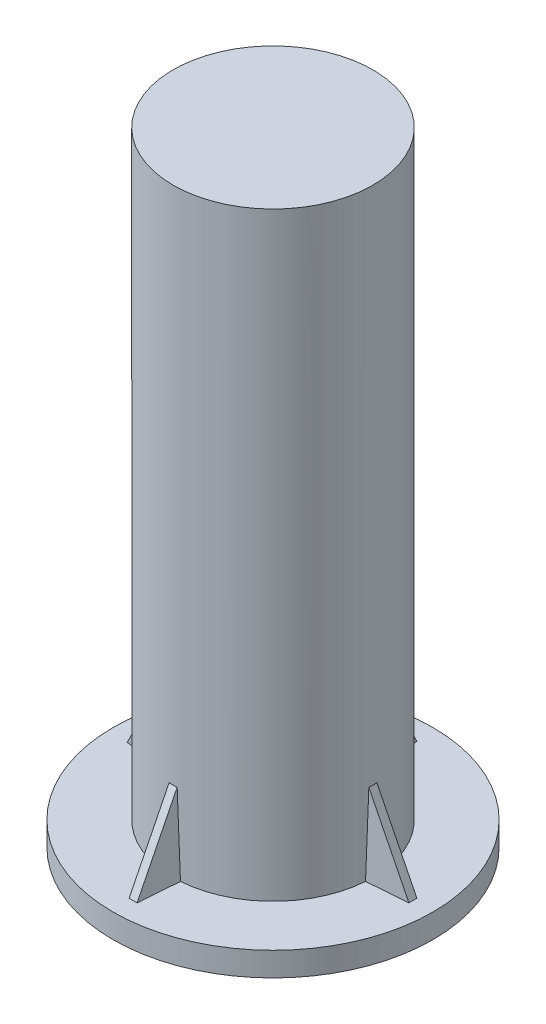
from build123d import *

# Parameters (mm, degrees)
CROQUIS1_R              = 40
CROQUIS1_R_2            = 5
SALIENTE_EXTRUIR2_DEPTH = 6
CROQUIS3_R              = 25
SALIENTE_EXTRUIR3_DEPTH = 150
NERVIO26_REACH          = 167.94
CROQUIS9_WALL_W         = 356.240175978
CROQUIS9_WALL_H         = 3
NERVIO26_DRAFT_ANGLE    = 5
NERVIO27_REACH          = 167.94
CROQUIS11_WALL_W        = 356.240175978
CROQUIS11_WALL_H        = 2
NERVIO27_DRAFT_ANGLE    = 5
NERVIO28_REACH          = 167.94
CROQUIS12_WALL_W        = 356.240175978
CROQUIS12_WALL_H        = 2
NERVIO28_DRAFT_ANGLE    = 5
NERVIO29_REACH          = 167.94
CROQUIS13_WALL_W        = 356.240175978
CROQUIS13_WALL_H        = 2
NERVIO29_DRAFT_ANGLE    = 5


with BuildPart() as part:
    # Croquis1 → Saliente-Extruir2 (new body)
    with BuildSketch(Plane(origin=(0, 0, 0), x_dir=(1, 0, 0), z_dir=(0, 1, 0))):
        with Locations(Location((0, 0, 0), (0, 0, 270))):
            Circle(CROQUIS1_R)
        with Locations(Location((0, 0, 0), (0, 0, 270))):
            Circle(CROQUIS1_R_2, mode=Mode.SUBTRACT)
    extrude(amount=SALIENTE_EXTRUIR2_DEPTH)

    # Croquis3 → Saliente-Extruir3 (add)
    with BuildSketch(Plane(origin=(0, 6, 0), x_dir=(1, 0, 0), z_dir=(0, 1, 0))):
        with Locations(Location((0, 0, 0), (0, 0, 270))):
            Circle(CROQUIS3_R)
    extrude(amount=SALIENTE_EXTRUIR3_DEPTH)

    # Croquis9 wall → Nervio26 (add, up to next)
    with BuildSketch(Plane(origin=(-30, 16, 0), x_dir=(0.4472135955, 0.894427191, 0), z_dir=(-0.894427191, 0.4472135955, 0)), mode=Mode.PRIVATE) as nervio26_sk1:
        Rectangle(CROQUIS9_WALL_W, CROQUIS9_WALL_H)
    nervio26_tool1 = extrude(nervio26_sk1.sketch, amount=-NERVIO26_REACH, mode=Mode.PRIVATE) - part.part
    add(nervio26_tool1.solids().sort_by_distance((-30, 16, 0))[0])

    # Nervio26 draft
    nervio26_draft_faces = [part.faces().sort_by_distance(p)[0] for p in [
        (-29.552786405, 15.776393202, -1.5),
        (-29.552786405, 15.776393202, 1.5),
    ]]
    draft(nervio26_draft_faces, Plane(origin=(-30, 16, 0), x_dir=(0.4472135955, 0.894427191, 0), z_dir=(-0.894427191, 0.4472135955, 0)), NERVIO26_DRAFT_ANGLE)

    # Croquis11 wall → Nervio27 (add, up to next)
    with BuildSketch(Plane(origin=(30, 16, 0), x_dir=(-0.4472135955, 0.894427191, 0), z_dir=(-0.894427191, -0.4472135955, 0)), mode=Mode.PRIVATE) as nervio27_sk1:
        Rectangle(CROQUIS11_WALL_W, CROQUIS11_WALL_H)
    nervio27_tool1 = extrude(nervio27_sk1.sketch, amount=NERVIO27_REACH, mode=Mode.PRIVATE) - part.part
    add(nervio27_tool1.solids().sort_by_distance((30, 16, 0))[0])

    # Nervio27 draft
    nervio27_draft_faces = [part.faces().sort_by_distance(p)[0] for p in [
        (29.552786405, 15.776393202, -1),
        (29.552786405, 15.776393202, 1),
    ]]
    draft(nervio27_draft_faces, Plane(origin=(30, 16, 0), x_dir=(-0.4472135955, 0.894427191, 0), z_dir=(0.894427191, 0.4472135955, 0)), NERVIO27_DRAFT_ANGLE)

    # Croquis12 wall → Nervio28 (add, up to next)
    with BuildSketch(Plane(origin=(0, 16, 30), x_dir=(0, 0.894427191, -0.4472135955), z_dir=(0, 0.4472135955, 0.894427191)), mode=Mode.PRIVATE) as nervio28_sk1:
        Rectangle(CROQUIS12_WALL_W, CROQUIS12_WALL_H)
    nervio28_tool1 = extrude(nervio28_sk1.sketch, amount=-NERVIO28_REACH, mode=Mode.PRIVATE) - part.part
    add(nervio28_tool1.solids().sort_by_distance((0, 16, 30))[0])

    # Nervio28 draft
    nervio28_draft_faces = [part.faces().sort_by_distance(p)[0] for p in [
        (-1, 15.776393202, 29.552786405),
        (1, 15.776393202, 29.552786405),
    ]]
    draft(nervio28_draft_faces, Plane(origin=(0, 16, 30), x_dir=(0, 0.894427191, -0.4472135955), z_dir=(0, 0.4472135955, 0.894427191)), NERVIO28_DRAFT_ANGLE)

    # Croquis13 wall → Nervio29 (add, up to next)
    with BuildSketch(Plane(origin=(0, 16, -30), x_dir=(0, 0.894427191, 0.4472135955), z_dir=(0, -0.4472135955, 0.894427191)), mode=Mode.PRIVATE) as nervio29_sk1:
        Rectangle(CROQUIS13_WALL_W, CROQUIS13_WALL_H)
    nervio29_tool1 = extrude(nervio29_sk1.sketch, amount=NERVIO29_REACH, mode=Mode.PRIVATE) - part.part
    add(nervio29_tool1.solids().sort_by_distance((0, 16, -30))[0])

    # Nervio29 draft
    nervio29_draft_faces = [part.faces().sort_by_distance(p)[0] for p in [
        (-1, 15.776393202, -29.552786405),
        (1, 15.776393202, -29.552786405),
    ]]
    draft(nervio29_draft_faces, Plane(origin=(0, 16, -30), x_dir=(0, 0.894427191, 0.4472135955), z_dir=(0, 0.4472135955, -0.894427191)), NERVIO29_DRAFT_ANGLE)


solid = part.part
